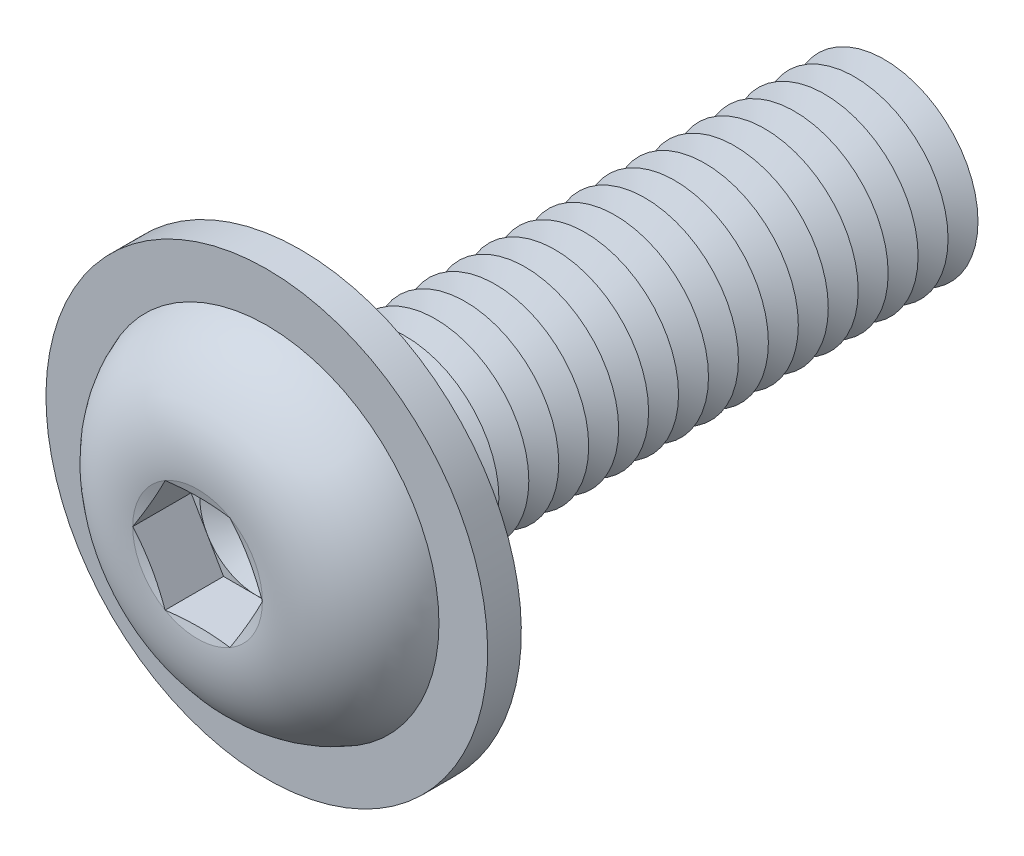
ISO-10303-21;
HEADER;
FILE_DESCRIPTION(('STEP AP214'),'2;1');
FILE_NAME('part.step','',(''),(''),'','','');
FILE_SCHEMA(('AUTOMOTIVE_DESIGN { 1 0 10303 214 1 1 1 1 }'));
ENDSEC;
DATA;
#1=APPLICATION_CONTEXT('core data for automotive mechanical design processes');
#2=APPLICATION_PROTOCOL_DEFINITION('international standard','automotive_design',2000,#1);
#3=PRODUCT_CONTEXT('',#1,'mechanical');
#4=PRODUCT('Part','Part','',(#3));
#5=PRODUCT_RELATED_PRODUCT_CATEGORY('part','',(#4));
#6=PRODUCT_DEFINITION_FORMATION('','',#4);
#7=PRODUCT_DEFINITION_CONTEXT('part definition',#1,'design');
#8=PRODUCT_DEFINITION('design','',#6,#7);
#9=PRODUCT_DEFINITION_SHAPE('','',#8);
#10=(LENGTH_UNIT() NAMED_UNIT(*) SI_UNIT(.MILLI.,.METRE.));
#11=(NAMED_UNIT(*) PLANE_ANGLE_UNIT() SI_UNIT($,.RADIAN.));
#12=(NAMED_UNIT(*) SI_UNIT($,.STERADIAN.) SOLID_ANGLE_UNIT());
#13=UNCERTAINTY_MEASURE_WITH_UNIT(LENGTH_MEASURE(1.E-05),#10,'distance_accuracy_value','');
#14=(GEOMETRIC_REPRESENTATION_CONTEXT(3) GLOBAL_UNCERTAINTY_ASSIGNED_CONTEXT((#13)) GLOBAL_UNIT_ASSIGNED_CONTEXT((#10,
#11,#12)) REPRESENTATION_CONTEXT('',''));
#15=CARTESIAN_POINT('',(0.,0.,0.));
#16=DIRECTION('',(0.,0.,1.));
#17=DIRECTION('',(1.,0.,0.));
#18=AXIS2_PLACEMENT_3D('',#15,#16,#17);
#19=CARTESIAN_POINT('',(0.,0.,-13.2));
#20=DIRECTION('',(0.,0.,1.));
#21=DIRECTION('',(1.,0.,0.));
#22=AXIS2_PLACEMENT_3D('',#19,#20,#21);
#23=CONICAL_SURFACE('',#22,2.50000000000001,1.0471975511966);
#24=CARTESIAN_POINT('',(0.,0.,-13.6));
#25=DIRECTION('',(0.,0.,1.));
#26=DIRECTION('',(1.,0.,0.));
#27=AXIS2_PLACEMENT_3D('',#24,#25,#26);
#28=CIRCLE('',#27,1.80717967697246);
#29=CARTESIAN_POINT('',(1.80717967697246,0.,-13.6));
#30=VERTEX_POINT('',#29);
#31=EDGE_CURVE('E371',#30,#30,#28,.T.);
#32=ORIENTED_EDGE('',*,*,#31,.T.);
#33=EDGE_LOOP('',(#32));
#34=FACE_BOUND('',#33,.T.);
#35=CARTESIAN_POINT('',(0.,0.,-13.2));
#36=DIRECTION('',(0.,0.,1.));
#37=DIRECTION('',(1.,0.,0.));
#38=AXIS2_PLACEMENT_3D('',#35,#36,#37);
#39=CIRCLE('',#38,2.50000000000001);
#40=CARTESIAN_POINT('',(2.50000000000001,0.,-13.2));
#41=VERTEX_POINT('',#40);
#42=EDGE_CURVE('E367',#41,#41,#39,.T.);
#43=ORIENTED_EDGE('',*,*,#42,.F.);
#44=EDGE_LOOP('',(#43));
#45=FACE_BOUND('',#44,.T.);
#46=ADVANCED_FACE('F39',(#34,#45),#23,.T.);
#47=CARTESIAN_POINT('',(0.,0.,-13.6));
#48=DIRECTION('',(0.,0.,-1.));
#49=DIRECTION('',(-1.,0.,0.));
#50=AXIS2_PLACEMENT_3D('',#47,#48,#49);
#51=CONICAL_SURFACE('',#50,1.80717967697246,1.0471975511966);
#52=CARTESIAN_POINT('',(0.,0.,-14.));
#53=DIRECTION('',(0.,0.,1.));
#54=DIRECTION('',(1.,0.,0.));
#55=AXIS2_PLACEMENT_3D('',#52,#53,#54);
#56=CIRCLE('',#55,2.50000000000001);
#57=CARTESIAN_POINT('',(2.50000000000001,0.,-14.));
#58=VERTEX_POINT('',#57);
#59=EDGE_CURVE('E375',#58,#58,#56,.T.);
#60=ORIENTED_EDGE('',*,*,#59,.T.);
#61=EDGE_LOOP('',(#60));
#62=FACE_BOUND('',#61,.T.);
#63=ORIENTED_EDGE('',*,*,#31,.F.);
#64=EDGE_LOOP('',(#63));
#65=FACE_BOUND('',#64,.T.);
#66=ADVANCED_FACE('F503',(#62,#65),#51,.T.);
#67=CARTESIAN_POINT('',(0.,2.50000000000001,-16.));
#68=DIRECTION('',(0.,0.,-1.));
#69=DIRECTION('',(-1.,0.,0.));
#70=AXIS2_PLACEMENT_3D('',#67,#68,#69);
#71=PLANE('',#70);
#72=CARTESIAN_POINT('',(0.,0.,-16.));
#73=DIRECTION('',(0.,0.,1.));
#74=DIRECTION('',(1.,0.,0.));
#75=AXIS2_PLACEMENT_3D('',#72,#73,#74);
#76=CIRCLE('',#75,1.80717967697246);
#77=CARTESIAN_POINT('',(1.80717967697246,0.,-16.));
#78=VERTEX_POINT('',#77);
#79=EDGE_CURVE('E395',#78,#78,#76,.T.);
#80=ORIENTED_EDGE('',*,*,#79,.F.);
#81=EDGE_LOOP('',(#80));
#82=FACE_BOUND('',#81,.T.);
#83=ADVANCED_FACE('F509',(#82),#71,.T.);
#84=CARTESIAN_POINT('',(0.,0.,-15.6));
#85=DIRECTION('',(0.,0.,1.));
#86=DIRECTION('',(1.,0.,0.));
#87=AXIS2_PLACEMENT_3D('',#84,#85,#86);
#88=CONICAL_SURFACE('',#87,2.50000000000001,1.0471975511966);
#89=ORIENTED_EDGE('',*,*,#79,.T.);
#90=EDGE_LOOP('',(#89));
#91=FACE_BOUND('',#90,.T.);
#92=CARTESIAN_POINT('',(0.,0.,-15.6));
#93=DIRECTION('',(0.,0.,1.));
#94=DIRECTION('',(1.,0.,0.));
#95=AXIS2_PLACEMENT_3D('',#92,#93,#94);
#96=CIRCLE('',#95,2.50000000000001);
#97=CARTESIAN_POINT('',(2.50000000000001,0.,-15.6));
#98=VERTEX_POINT('',#97);
#99=EDGE_CURVE('E391',#98,#98,#96,.T.);
#100=ORIENTED_EDGE('',*,*,#99,.F.);
#101=EDGE_LOOP('',(#100));
#102=FACE_BOUND('',#101,.T.);
#103=ADVANCED_FACE('F528',(#91,#102),#88,.T.);
#104=CARTESIAN_POINT('',(0.,0.,-15.2));
#105=DIRECTION('',(0.,0.,-1.));
#106=DIRECTION('',(-1.,0.,0.));
#107=AXIS2_PLACEMENT_3D('',#104,#105,#106);
#108=CONICAL_SURFACE('',#107,1.80717967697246,1.0471975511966);
#109=ORIENTED_EDGE('',*,*,#99,.T.);
#110=EDGE_LOOP('',(#109));
#111=FACE_BOUND('',#110,.T.);
#112=CARTESIAN_POINT('',(0.,0.,-15.2));
#113=DIRECTION('',(0.,0.,1.));
#114=DIRECTION('',(1.,0.,0.));
#115=AXIS2_PLACEMENT_3D('',#112,#113,#114);
#116=CIRCLE('',#115,1.80717967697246);
#117=CARTESIAN_POINT('',(1.80717967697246,0.,-15.2));
#118=VERTEX_POINT('',#117);
#119=EDGE_CURVE('E387',#118,#118,#116,.T.);
#120=ORIENTED_EDGE('',*,*,#119,.F.);
#121=EDGE_LOOP('',(#120));
#122=FACE_BOUND('',#121,.T.);
#123=ADVANCED_FACE('F525',(#111,#122),#108,.T.);
#124=CARTESIAN_POINT('',(0.,0.,-14.8));
#125=DIRECTION('',(0.,0.,1.));
#126=DIRECTION('',(1.,0.,0.));
#127=AXIS2_PLACEMENT_3D('',#124,#125,#126);
#128=CONICAL_SURFACE('',#127,2.50000000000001,1.0471975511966);
#129=ORIENTED_EDGE('',*,*,#119,.T.);
#130=EDGE_LOOP('',(#129));
#131=FACE_BOUND('',#130,.T.);
#132=CARTESIAN_POINT('',(0.,0.,-14.8));
#133=DIRECTION('',(0.,0.,1.));
#134=DIRECTION('',(1.,0.,0.));
#135=AXIS2_PLACEMENT_3D('',#132,#133,#134);
#136=CIRCLE('',#135,2.50000000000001);
#137=CARTESIAN_POINT('',(2.50000000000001,0.,-14.8));
#138=VERTEX_POINT('',#137);
#139=EDGE_CURVE('E383',#138,#138,#136,.T.);
#140=ORIENTED_EDGE('',*,*,#139,.F.);
#141=EDGE_LOOP('',(#140));
#142=FACE_BOUND('',#141,.T.);
#143=ADVANCED_FACE('F519',(#131,#142),#128,.T.);
#144=CARTESIAN_POINT('',(0.,0.,-14.4));
#145=DIRECTION('',(0.,0.,-1.));
#146=DIRECTION('',(-1.,0.,0.));
#147=AXIS2_PLACEMENT_3D('',#144,#145,#146);
#148=CONICAL_SURFACE('',#147,1.80717967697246,1.0471975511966);
#149=ORIENTED_EDGE('',*,*,#139,.T.);
#150=EDGE_LOOP('',(#149));
#151=FACE_BOUND('',#150,.T.);
#152=CARTESIAN_POINT('',(0.,0.,-14.4));
#153=DIRECTION('',(0.,0.,1.));
#154=DIRECTION('',(1.,0.,0.));
#155=AXIS2_PLACEMENT_3D('',#152,#153,#154);
#156=CIRCLE('',#155,1.80717967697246);
#157=CARTESIAN_POINT('',(1.80717967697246,0.,-14.4));
#158=VERTEX_POINT('',#157);
#159=EDGE_CURVE('E379',#158,#158,#156,.T.);
#160=ORIENTED_EDGE('',*,*,#159,.F.);
#161=EDGE_LOOP('',(#160));
#162=FACE_BOUND('',#161,.T.);
#163=ADVANCED_FACE('F515',(#151,#162),#148,.T.);
#164=CARTESIAN_POINT('',(0.,0.,-14.));
#165=DIRECTION('',(0.,0.,1.));
#166=DIRECTION('',(1.,0.,0.));
#167=AXIS2_PLACEMENT_3D('',#164,#165,#166);
#168=CONICAL_SURFACE('',#167,2.50000000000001,1.0471975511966);
#169=ORIENTED_EDGE('',*,*,#159,.T.);
#170=EDGE_LOOP('',(#169));
#171=FACE_BOUND('',#170,.T.);
#172=ORIENTED_EDGE('',*,*,#59,.F.);
#173=EDGE_LOOP('',(#172));
#174=FACE_BOUND('',#173,.T.);
#175=ADVANCED_FACE('F518',(#171,#174),#168,.T.);
#176=CARTESIAN_POINT('',(0.,0.,-12.4));
#177=DIRECTION('',(0.,0.,1.));
#178=DIRECTION('',(1.,0.,0.));
#179=AXIS2_PLACEMENT_3D('',#176,#177,#178);
#180=CONICAL_SURFACE('',#179,2.50000000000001,1.0471975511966);
#181=CARTESIAN_POINT('',(0.,0.,-12.8));
#182=DIRECTION('',(0.,0.,1.));
#183=DIRECTION('',(1.,0.,0.));
#184=AXIS2_PLACEMENT_3D('',#181,#182,#183);
#185=CIRCLE('',#184,1.80717967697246);
#186=CARTESIAN_POINT('',(1.80717967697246,0.,-12.8));
#187=VERTEX_POINT('',#186);
#188=EDGE_CURVE('E363',#187,#187,#185,.T.);
#189=ORIENTED_EDGE('',*,*,#188,.T.);
#190=EDGE_LOOP('',(#189));
#191=FACE_BOUND('',#190,.T.);
#192=CARTESIAN_POINT('',(0.,0.,-12.4));
#193=DIRECTION('',(0.,0.,1.));
#194=DIRECTION('',(1.,0.,0.));
#195=AXIS2_PLACEMENT_3D('',#192,#193,#194);
#196=CIRCLE('',#195,2.50000000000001);
#197=CARTESIAN_POINT('',(2.50000000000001,0.,-12.4));
#198=VERTEX_POINT('',#197);
#199=EDGE_CURVE('E359',#198,#198,#196,.T.);
#200=ORIENTED_EDGE('',*,*,#199,.F.);
#201=EDGE_LOOP('',(#200));
#202=FACE_BOUND('',#201,.T.);
#203=ADVANCED_FACE('F523',(#191,#202),#180,.T.);
#204=CARTESIAN_POINT('',(0.,0.,-12.8));
#205=DIRECTION('',(0.,0.,-1.));
#206=DIRECTION('',(-1.,0.,0.));
#207=AXIS2_PLACEMENT_3D('',#204,#205,#206);
#208=CONICAL_SURFACE('',#207,1.80717967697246,1.0471975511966);
#209=ORIENTED_EDGE('',*,*,#42,.T.);
#210=EDGE_LOOP('',(#209));
#211=FACE_BOUND('',#210,.T.);
#212=ORIENTED_EDGE('',*,*,#188,.F.);
#213=EDGE_LOOP('',(#212));
#214=FACE_BOUND('',#213,.T.);
#215=ADVANCED_FACE('F574',(#211,#214),#208,.T.);
#216=CARTESIAN_POINT('',(0.,0.,-11.6));
#217=DIRECTION('',(0.,0.,1.));
#218=DIRECTION('',(1.,0.,0.));
#219=AXIS2_PLACEMENT_3D('',#216,#217,#218);
#220=CONICAL_SURFACE('',#219,2.50000000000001,1.0471975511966);
#221=CARTESIAN_POINT('',(0.,0.,-12.));
#222=DIRECTION('',(0.,0.,1.));
#223=DIRECTION('',(1.,0.,0.));
#224=AXIS2_PLACEMENT_3D('',#221,#222,#223);
#225=CIRCLE('',#224,1.80717967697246);
#226=CARTESIAN_POINT('',(1.80717967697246,0.,-12.));
#227=VERTEX_POINT('',#226);
#228=EDGE_CURVE('E355',#227,#227,#225,.T.);
#229=ORIENTED_EDGE('',*,*,#228,.T.);
#230=EDGE_LOOP('',(#229));
#231=FACE_BOUND('',#230,.T.);
#232=CARTESIAN_POINT('',(0.,0.,-11.6));
#233=DIRECTION('',(0.,0.,1.));
#234=DIRECTION('',(1.,0.,0.));
#235=AXIS2_PLACEMENT_3D('',#232,#233,#234);
#236=CIRCLE('',#235,2.50000000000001);
#237=CARTESIAN_POINT('',(2.50000000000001,0.,-11.6));
#238=VERTEX_POINT('',#237);
#239=EDGE_CURVE('E351',#238,#238,#236,.T.);
#240=ORIENTED_EDGE('',*,*,#239,.F.);
#241=EDGE_LOOP('',(#240));
#242=FACE_BOUND('',#241,.T.);
#243=ADVANCED_FACE('F580',(#231,#242),#220,.T.);
#244=CARTESIAN_POINT('',(0.,0.,-12.));
#245=DIRECTION('',(0.,0.,-1.));
#246=DIRECTION('',(-1.,0.,0.));
#247=AXIS2_PLACEMENT_3D('',#244,#245,#246);
#248=CONICAL_SURFACE('',#247,1.80717967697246,1.0471975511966);
#249=ORIENTED_EDGE('',*,*,#199,.T.);
#250=EDGE_LOOP('',(#249));
#251=FACE_BOUND('',#250,.T.);
#252=ORIENTED_EDGE('',*,*,#228,.F.);
#253=EDGE_LOOP('',(#252));
#254=FACE_BOUND('',#253,.T.);
#255=ADVANCED_FACE('F587',(#251,#254),#248,.T.);
#256=CARTESIAN_POINT('',(0.,0.,-10.8));
#257=DIRECTION('',(0.,0.,1.));
#258=DIRECTION('',(1.,0.,0.));
#259=AXIS2_PLACEMENT_3D('',#256,#257,#258);
#260=CONICAL_SURFACE('',#259,2.50000000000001,1.0471975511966);
#261=CARTESIAN_POINT('',(0.,0.,-11.2));
#262=DIRECTION('',(0.,0.,1.));
#263=DIRECTION('',(1.,0.,0.));
#264=AXIS2_PLACEMENT_3D('',#261,#262,#263);
#265=CIRCLE('',#264,1.80717967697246);
#266=CARTESIAN_POINT('',(1.80717967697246,0.,-11.2));
#267=VERTEX_POINT('',#266);
#268=EDGE_CURVE('E347',#267,#267,#265,.T.);
#269=ORIENTED_EDGE('',*,*,#268,.T.);
#270=EDGE_LOOP('',(#269));
#271=FACE_BOUND('',#270,.T.);
#272=CARTESIAN_POINT('',(0.,0.,-10.8));
#273=DIRECTION('',(0.,0.,1.));
#274=DIRECTION('',(1.,0.,0.));
#275=AXIS2_PLACEMENT_3D('',#272,#273,#274);
#276=CIRCLE('',#275,2.50000000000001);
#277=CARTESIAN_POINT('',(2.50000000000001,0.,-10.8));
#278=VERTEX_POINT('',#277);
#279=EDGE_CURVE('E343',#278,#278,#276,.T.);
#280=ORIENTED_EDGE('',*,*,#279,.F.);
#281=EDGE_LOOP('',(#280));
#282=FACE_BOUND('',#281,.T.);
#283=ADVANCED_FACE('F594',(#271,#282),#260,.T.);
#284=CARTESIAN_POINT('',(0.,0.,-11.2));
#285=DIRECTION('',(0.,0.,-1.));
#286=DIRECTION('',(-1.,0.,0.));
#287=AXIS2_PLACEMENT_3D('',#284,#285,#286);
#288=CONICAL_SURFACE('',#287,1.80717967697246,1.0471975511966);
#289=ORIENTED_EDGE('',*,*,#239,.T.);
#290=EDGE_LOOP('',(#289));
#291=FACE_BOUND('',#290,.T.);
#292=ORIENTED_EDGE('',*,*,#268,.F.);
#293=EDGE_LOOP('',(#292));
#294=FACE_BOUND('',#293,.T.);
#295=ADVANCED_FACE('F601',(#291,#294),#288,.T.);
#296=CARTESIAN_POINT('',(0.,0.,-10.));
#297=DIRECTION('',(0.,0.,1.));
#298=DIRECTION('',(1.,0.,0.));
#299=AXIS2_PLACEMENT_3D('',#296,#297,#298);
#300=CONICAL_SURFACE('',#299,2.50000000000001,1.0471975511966);
#301=CARTESIAN_POINT('',(0.,0.,-10.4));
#302=DIRECTION('',(0.,0.,1.));
#303=DIRECTION('',(1.,0.,0.));
#304=AXIS2_PLACEMENT_3D('',#301,#302,#303);
#305=CIRCLE('',#304,1.80717967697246);
#306=CARTESIAN_POINT('',(1.80717967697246,0.,-10.4));
#307=VERTEX_POINT('',#306);
#308=EDGE_CURVE('E339',#307,#307,#305,.T.);
#309=ORIENTED_EDGE('',*,*,#308,.T.);
#310=EDGE_LOOP('',(#309));
#311=FACE_BOUND('',#310,.T.);
#312=CARTESIAN_POINT('',(0.,0.,-10.));
#313=DIRECTION('',(0.,0.,1.));
#314=DIRECTION('',(1.,0.,0.));
#315=AXIS2_PLACEMENT_3D('',#312,#313,#314);
#316=CIRCLE('',#315,2.50000000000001);
#317=CARTESIAN_POINT('',(2.50000000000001,0.,-10.));
#318=VERTEX_POINT('',#317);
#319=EDGE_CURVE('E335',#318,#318,#316,.T.);
#320=ORIENTED_EDGE('',*,*,#319,.F.);
#321=EDGE_LOOP('',(#320));
#322=FACE_BOUND('',#321,.T.);
#323=ADVANCED_FACE('F608',(#311,#322),#300,.T.);
#324=CARTESIAN_POINT('',(0.,0.,-10.4));
#325=DIRECTION('',(0.,0.,-1.));
#326=DIRECTION('',(-1.,0.,0.));
#327=AXIS2_PLACEMENT_3D('',#324,#325,#326);
#328=CONICAL_SURFACE('',#327,1.80717967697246,1.0471975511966);
#329=ORIENTED_EDGE('',*,*,#279,.T.);
#330=EDGE_LOOP('',(#329));
#331=FACE_BOUND('',#330,.T.);
#332=ORIENTED_EDGE('',*,*,#308,.F.);
#333=EDGE_LOOP('',(#332));
#334=FACE_BOUND('',#333,.T.);
#335=ADVANCED_FACE('F615',(#331,#334),#328,.T.);
#336=CARTESIAN_POINT('',(0.,0.,-9.2));
#337=DIRECTION('',(0.,0.,1.));
#338=DIRECTION('',(1.,0.,0.));
#339=AXIS2_PLACEMENT_3D('',#336,#337,#338);
#340=CONICAL_SURFACE('',#339,2.50000000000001,1.0471975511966);
#341=CARTESIAN_POINT('',(0.,0.,-9.6));
#342=DIRECTION('',(0.,0.,1.));
#343=DIRECTION('',(1.,0.,0.));
#344=AXIS2_PLACEMENT_3D('',#341,#342,#343);
#345=CIRCLE('',#344,1.80717967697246);
#346=CARTESIAN_POINT('',(1.80717967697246,0.,-9.6));
#347=VERTEX_POINT('',#346);
#348=EDGE_CURVE('E331',#347,#347,#345,.T.);
#349=ORIENTED_EDGE('',*,*,#348,.T.);
#350=EDGE_LOOP('',(#349));
#351=FACE_BOUND('',#350,.T.);
#352=CARTESIAN_POINT('',(0.,0.,-9.2));
#353=DIRECTION('',(0.,0.,1.));
#354=DIRECTION('',(1.,0.,0.));
#355=AXIS2_PLACEMENT_3D('',#352,#353,#354);
#356=CIRCLE('',#355,2.50000000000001);
#357=CARTESIAN_POINT('',(2.50000000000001,0.,-9.2));
#358=VERTEX_POINT('',#357);
#359=EDGE_CURVE('E327',#358,#358,#356,.T.);
#360=ORIENTED_EDGE('',*,*,#359,.F.);
#361=EDGE_LOOP('',(#360));
#362=FACE_BOUND('',#361,.T.);
#363=ADVANCED_FACE('F622',(#351,#362),#340,.T.);
#364=CARTESIAN_POINT('',(0.,0.,-9.6));
#365=DIRECTION('',(0.,0.,-1.));
#366=DIRECTION('',(-1.,0.,0.));
#367=AXIS2_PLACEMENT_3D('',#364,#365,#366);
#368=CONICAL_SURFACE('',#367,1.80717967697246,1.0471975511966);
#369=ORIENTED_EDGE('',*,*,#319,.T.);
#370=EDGE_LOOP('',(#369));
#371=FACE_BOUND('',#370,.T.);
#372=ORIENTED_EDGE('',*,*,#348,.F.);
#373=EDGE_LOOP('',(#372));
#374=FACE_BOUND('',#373,.T.);
#375=ADVANCED_FACE('F629',(#371,#374),#368,.T.);
#376=CARTESIAN_POINT('',(0.,0.,-8.4));
#377=DIRECTION('',(0.,0.,1.));
#378=DIRECTION('',(1.,0.,0.));
#379=AXIS2_PLACEMENT_3D('',#376,#377,#378);
#380=CONICAL_SURFACE('',#379,2.50000000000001,1.0471975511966);
#381=CARTESIAN_POINT('',(0.,0.,-8.8));
#382=DIRECTION('',(0.,0.,1.));
#383=DIRECTION('',(1.,0.,0.));
#384=AXIS2_PLACEMENT_3D('',#381,#382,#383);
#385=CIRCLE('',#384,1.80717967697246);
#386=CARTESIAN_POINT('',(1.80717967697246,0.,-8.8));
#387=VERTEX_POINT('',#386);
#388=EDGE_CURVE('E323',#387,#387,#385,.T.);
#389=ORIENTED_EDGE('',*,*,#388,.T.);
#390=EDGE_LOOP('',(#389));
#391=FACE_BOUND('',#390,.T.);
#392=CARTESIAN_POINT('',(0.,0.,-8.4));
#393=DIRECTION('',(0.,0.,1.));
#394=DIRECTION('',(1.,0.,0.));
#395=AXIS2_PLACEMENT_3D('',#392,#393,#394);
#396=CIRCLE('',#395,2.50000000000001);
#397=CARTESIAN_POINT('',(2.50000000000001,0.,-8.4));
#398=VERTEX_POINT('',#397);
#399=EDGE_CURVE('E319',#398,#398,#396,.T.);
#400=ORIENTED_EDGE('',*,*,#399,.F.);
#401=EDGE_LOOP('',(#400));
#402=FACE_BOUND('',#401,.T.);
#403=ADVANCED_FACE('F636',(#391,#402),#380,.T.);
#404=CARTESIAN_POINT('',(0.,0.,-8.8));
#405=DIRECTION('',(0.,0.,-1.));
#406=DIRECTION('',(-1.,0.,0.));
#407=AXIS2_PLACEMENT_3D('',#404,#405,#406);
#408=CONICAL_SURFACE('',#407,1.80717967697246,1.0471975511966);
#409=ORIENTED_EDGE('',*,*,#359,.T.);
#410=EDGE_LOOP('',(#409));
#411=FACE_BOUND('',#410,.T.);
#412=ORIENTED_EDGE('',*,*,#388,.F.);
#413=EDGE_LOOP('',(#412));
#414=FACE_BOUND('',#413,.T.);
#415=ADVANCED_FACE('F643',(#411,#414),#408,.T.);
#416=CARTESIAN_POINT('',(0.,0.,-7.6));
#417=DIRECTION('',(0.,0.,1.));
#418=DIRECTION('',(1.,0.,0.));
#419=AXIS2_PLACEMENT_3D('',#416,#417,#418);
#420=CONICAL_SURFACE('',#419,2.50000000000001,1.0471975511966);
#421=CARTESIAN_POINT('',(0.,0.,-8.));
#422=DIRECTION('',(0.,0.,1.));
#423=DIRECTION('',(1.,0.,0.));
#424=AXIS2_PLACEMENT_3D('',#421,#422,#423);
#425=CIRCLE('',#424,1.80717967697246);
#426=CARTESIAN_POINT('',(1.80717967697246,0.,-8.));
#427=VERTEX_POINT('',#426);
#428=EDGE_CURVE('E315',#427,#427,#425,.T.);
#429=ORIENTED_EDGE('',*,*,#428,.T.);
#430=EDGE_LOOP('',(#429));
#431=FACE_BOUND('',#430,.T.);
#432=CARTESIAN_POINT('',(0.,0.,-7.6));
#433=DIRECTION('',(0.,0.,1.));
#434=DIRECTION('',(1.,0.,0.));
#435=AXIS2_PLACEMENT_3D('',#432,#433,#434);
#436=CIRCLE('',#435,2.50000000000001);
#437=CARTESIAN_POINT('',(2.50000000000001,0.,-7.6));
#438=VERTEX_POINT('',#437);
#439=EDGE_CURVE('E311',#438,#438,#436,.T.);
#440=ORIENTED_EDGE('',*,*,#439,.F.);
#441=EDGE_LOOP('',(#440));
#442=FACE_BOUND('',#441,.T.);
#443=ADVANCED_FACE('F650',(#431,#442),#420,.T.);
#444=CARTESIAN_POINT('',(0.,0.,-8.));
#445=DIRECTION('',(0.,0.,-1.));
#446=DIRECTION('',(-1.,0.,0.));
#447=AXIS2_PLACEMENT_3D('',#444,#445,#446);
#448=CONICAL_SURFACE('',#447,1.80717967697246,1.0471975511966);
#449=ORIENTED_EDGE('',*,*,#399,.T.);
#450=EDGE_LOOP('',(#449));
#451=FACE_BOUND('',#450,.T.);
#452=ORIENTED_EDGE('',*,*,#428,.F.);
#453=EDGE_LOOP('',(#452));
#454=FACE_BOUND('',#453,.T.);
#455=ADVANCED_FACE('F657',(#451,#454),#448,.T.);
#456=CARTESIAN_POINT('',(0.,0.,-6.8));
#457=DIRECTION('',(0.,0.,1.));
#458=DIRECTION('',(1.,0.,0.));
#459=AXIS2_PLACEMENT_3D('',#456,#457,#458);
#460=CONICAL_SURFACE('',#459,2.50000000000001,1.0471975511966);
#461=CARTESIAN_POINT('',(0.,0.,-7.2));
#462=DIRECTION('',(0.,0.,1.));
#463=DIRECTION('',(1.,0.,0.));
#464=AXIS2_PLACEMENT_3D('',#461,#462,#463);
#465=CIRCLE('',#464,1.80717967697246);
#466=CARTESIAN_POINT('',(1.80717967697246,0.,-7.2));
#467=VERTEX_POINT('',#466);
#468=EDGE_CURVE('E307',#467,#467,#465,.T.);
#469=ORIENTED_EDGE('',*,*,#468,.T.);
#470=EDGE_LOOP('',(#469));
#471=FACE_BOUND('',#470,.T.);
#472=CARTESIAN_POINT('',(0.,0.,-6.8));
#473=DIRECTION('',(0.,0.,1.));
#474=DIRECTION('',(1.,0.,0.));
#475=AXIS2_PLACEMENT_3D('',#472,#473,#474);
#476=CIRCLE('',#475,2.50000000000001);
#477=CARTESIAN_POINT('',(2.50000000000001,0.,-6.8));
#478=VERTEX_POINT('',#477);
#479=EDGE_CURVE('E303',#478,#478,#476,.T.);
#480=ORIENTED_EDGE('',*,*,#479,.F.);
#481=EDGE_LOOP('',(#480));
#482=FACE_BOUND('',#481,.T.);
#483=ADVANCED_FACE('F664',(#471,#482),#460,.T.);
#484=CARTESIAN_POINT('',(0.,0.,-7.2));
#485=DIRECTION('',(0.,0.,-1.));
#486=DIRECTION('',(-1.,0.,0.));
#487=AXIS2_PLACEMENT_3D('',#484,#485,#486);
#488=CONICAL_SURFACE('',#487,1.80717967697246,1.0471975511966);
#489=ORIENTED_EDGE('',*,*,#439,.T.);
#490=EDGE_LOOP('',(#489));
#491=FACE_BOUND('',#490,.T.);
#492=ORIENTED_EDGE('',*,*,#468,.F.);
#493=EDGE_LOOP('',(#492));
#494=FACE_BOUND('',#493,.T.);
#495=ADVANCED_FACE('F671',(#491,#494),#488,.T.);
#496=CARTESIAN_POINT('',(0.,0.,-6.));
#497=DIRECTION('',(0.,0.,1.));
#498=DIRECTION('',(1.,0.,0.));
#499=AXIS2_PLACEMENT_3D('',#496,#497,#498);
#500=CONICAL_SURFACE('',#499,2.50000000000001,1.0471975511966);
#501=CARTESIAN_POINT('',(0.,0.,-6.4));
#502=DIRECTION('',(0.,0.,1.));
#503=DIRECTION('',(1.,0.,0.));
#504=AXIS2_PLACEMENT_3D('',#501,#502,#503);
#505=CIRCLE('',#504,1.80717967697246);
#506=CARTESIAN_POINT('',(1.80717967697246,0.,-6.4));
#507=VERTEX_POINT('',#506);
#508=EDGE_CURVE('E299',#507,#507,#505,.T.);
#509=ORIENTED_EDGE('',*,*,#508,.T.);
#510=EDGE_LOOP('',(#509));
#511=FACE_BOUND('',#510,.T.);
#512=CARTESIAN_POINT('',(0.,0.,-6.));
#513=DIRECTION('',(0.,0.,1.));
#514=DIRECTION('',(1.,0.,0.));
#515=AXIS2_PLACEMENT_3D('',#512,#513,#514);
#516=CIRCLE('',#515,2.50000000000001);
#517=CARTESIAN_POINT('',(2.50000000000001,0.,-6.));
#518=VERTEX_POINT('',#517);
#519=EDGE_CURVE('E295',#518,#518,#516,.T.);
#520=ORIENTED_EDGE('',*,*,#519,.F.);
#521=EDGE_LOOP('',(#520));
#522=FACE_BOUND('',#521,.T.);
#523=ADVANCED_FACE('F678',(#511,#522),#500,.T.);
#524=CARTESIAN_POINT('',(0.,0.,-6.4));
#525=DIRECTION('',(0.,0.,-1.));
#526=DIRECTION('',(-1.,0.,0.));
#527=AXIS2_PLACEMENT_3D('',#524,#525,#526);
#528=CONICAL_SURFACE('',#527,1.80717967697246,1.0471975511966);
#529=ORIENTED_EDGE('',*,*,#479,.T.);
#530=EDGE_LOOP('',(#529));
#531=FACE_BOUND('',#530,.T.);
#532=ORIENTED_EDGE('',*,*,#508,.F.);
#533=EDGE_LOOP('',(#532));
#534=FACE_BOUND('',#533,.T.);
#535=ADVANCED_FACE('F685',(#531,#534),#528,.T.);
#536=CARTESIAN_POINT('',(0.,0.,-5.2));
#537=DIRECTION('',(0.,0.,1.));
#538=DIRECTION('',(1.,0.,0.));
#539=AXIS2_PLACEMENT_3D('',#536,#537,#538);
#540=CONICAL_SURFACE('',#539,2.50000000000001,1.0471975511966);
#541=CARTESIAN_POINT('',(0.,0.,-5.6));
#542=DIRECTION('',(0.,0.,1.));
#543=DIRECTION('',(1.,0.,0.));
#544=AXIS2_PLACEMENT_3D('',#541,#542,#543);
#545=CIRCLE('',#544,1.80717967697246);
#546=CARTESIAN_POINT('',(1.80717967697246,0.,-5.6));
#547=VERTEX_POINT('',#546);
#548=EDGE_CURVE('E291',#547,#547,#545,.T.);
#549=ORIENTED_EDGE('',*,*,#548,.T.);
#550=EDGE_LOOP('',(#549));
#551=FACE_BOUND('',#550,.T.);
#552=CARTESIAN_POINT('',(0.,0.,-5.2));
#553=DIRECTION('',(0.,0.,1.));
#554=DIRECTION('',(1.,0.,0.));
#555=AXIS2_PLACEMENT_3D('',#552,#553,#554);
#556=CIRCLE('',#555,2.50000000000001);
#557=CARTESIAN_POINT('',(2.50000000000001,0.,-5.2));
#558=VERTEX_POINT('',#557);
#559=EDGE_CURVE('E287',#558,#558,#556,.T.);
#560=ORIENTED_EDGE('',*,*,#559,.F.);
#561=EDGE_LOOP('',(#560));
#562=FACE_BOUND('',#561,.T.);
#563=ADVANCED_FACE('F692',(#551,#562),#540,.T.);
#564=CARTESIAN_POINT('',(0.,0.,-5.6));
#565=DIRECTION('',(0.,0.,-1.));
#566=DIRECTION('',(-1.,0.,0.));
#567=AXIS2_PLACEMENT_3D('',#564,#565,#566);
#568=CONICAL_SURFACE('',#567,1.80717967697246,1.0471975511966);
#569=ORIENTED_EDGE('',*,*,#519,.T.);
#570=EDGE_LOOP('',(#569));
#571=FACE_BOUND('',#570,.T.);
#572=ORIENTED_EDGE('',*,*,#548,.F.);
#573=EDGE_LOOP('',(#572));
#574=FACE_BOUND('',#573,.T.);
#575=ADVANCED_FACE('F699',(#571,#574),#568,.T.);
#576=CARTESIAN_POINT('',(0.,0.,-4.4));
#577=DIRECTION('',(0.,0.,1.));
#578=DIRECTION('',(1.,0.,0.));
#579=AXIS2_PLACEMENT_3D('',#576,#577,#578);
#580=CONICAL_SURFACE('',#579,2.50000000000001,1.0471975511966);
#581=CARTESIAN_POINT('',(0.,0.,-4.8));
#582=DIRECTION('',(0.,0.,1.));
#583=DIRECTION('',(1.,0.,0.));
#584=AXIS2_PLACEMENT_3D('',#581,#582,#583);
#585=CIRCLE('',#584,1.80717967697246);
#586=CARTESIAN_POINT('',(1.80717967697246,0.,-4.8));
#587=VERTEX_POINT('',#586);
#588=EDGE_CURVE('E283',#587,#587,#585,.T.);
#589=ORIENTED_EDGE('',*,*,#588,.T.);
#590=EDGE_LOOP('',(#589));
#591=FACE_BOUND('',#590,.T.);
#592=CARTESIAN_POINT('',(0.,0.,-4.4));
#593=DIRECTION('',(0.,0.,1.));
#594=DIRECTION('',(1.,0.,0.));
#595=AXIS2_PLACEMENT_3D('',#592,#593,#594);
#596=CIRCLE('',#595,2.50000000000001);
#597=CARTESIAN_POINT('',(2.50000000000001,0.,-4.4));
#598=VERTEX_POINT('',#597);
#599=EDGE_CURVE('E279',#598,#598,#596,.T.);
#600=ORIENTED_EDGE('',*,*,#599,.F.);
#601=EDGE_LOOP('',(#600));
#602=FACE_BOUND('',#601,.T.);
#603=ADVANCED_FACE('F706',(#591,#602),#580,.T.);
#604=CARTESIAN_POINT('',(0.,0.,-4.8));
#605=DIRECTION('',(0.,0.,-1.));
#606=DIRECTION('',(-1.,0.,0.));
#607=AXIS2_PLACEMENT_3D('',#604,#605,#606);
#608=CONICAL_SURFACE('',#607,1.80717967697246,1.0471975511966);
#609=ORIENTED_EDGE('',*,*,#559,.T.);
#610=EDGE_LOOP('',(#609));
#611=FACE_BOUND('',#610,.T.);
#612=ORIENTED_EDGE('',*,*,#588,.F.);
#613=EDGE_LOOP('',(#612));
#614=FACE_BOUND('',#613,.T.);
#615=ADVANCED_FACE('F713',(#611,#614),#608,.T.);
#616=CARTESIAN_POINT('',(0.,0.,-3.6));
#617=DIRECTION('',(0.,0.,1.));
#618=DIRECTION('',(1.,0.,0.));
#619=AXIS2_PLACEMENT_3D('',#616,#617,#618);
#620=CONICAL_SURFACE('',#619,2.50000000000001,1.0471975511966);
#621=CARTESIAN_POINT('',(0.,0.,-4.));
#622=DIRECTION('',(0.,0.,1.));
#623=DIRECTION('',(1.,0.,0.));
#624=AXIS2_PLACEMENT_3D('',#621,#622,#623);
#625=CIRCLE('',#624,1.80717967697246);
#626=CARTESIAN_POINT('',(1.80717967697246,0.,-4.));
#627=VERTEX_POINT('',#626);
#628=EDGE_CURVE('E275',#627,#627,#625,.T.);
#629=ORIENTED_EDGE('',*,*,#628,.T.);
#630=EDGE_LOOP('',(#629));
#631=FACE_BOUND('',#630,.T.);
#632=CARTESIAN_POINT('',(0.,0.,-3.6));
#633=DIRECTION('',(0.,0.,1.));
#634=DIRECTION('',(1.,0.,0.));
#635=AXIS2_PLACEMENT_3D('',#632,#633,#634);
#636=CIRCLE('',#635,2.50000000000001);
#637=CARTESIAN_POINT('',(2.50000000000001,0.,-3.6));
#638=VERTEX_POINT('',#637);
#639=EDGE_CURVE('E271',#638,#638,#636,.T.);
#640=ORIENTED_EDGE('',*,*,#639,.F.);
#641=EDGE_LOOP('',(#640));
#642=FACE_BOUND('',#641,.T.);
#643=ADVANCED_FACE('F720',(#631,#642),#620,.T.);
#644=CARTESIAN_POINT('',(0.,0.,-4.));
#645=DIRECTION('',(0.,0.,-1.));
#646=DIRECTION('',(-1.,0.,0.));
#647=AXIS2_PLACEMENT_3D('',#644,#645,#646);
#648=CONICAL_SURFACE('',#647,1.80717967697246,1.0471975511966);
#649=ORIENTED_EDGE('',*,*,#599,.T.);
#650=EDGE_LOOP('',(#649));
#651=FACE_BOUND('',#650,.T.);
#652=ORIENTED_EDGE('',*,*,#628,.F.);
#653=EDGE_LOOP('',(#652));
#654=FACE_BOUND('',#653,.T.);
#655=ADVANCED_FACE('F727',(#651,#654),#648,.T.);
#656=CARTESIAN_POINT('',(0.,0.,-2.8));
#657=DIRECTION('',(0.,0.,1.));
#658=DIRECTION('',(1.,0.,0.));
#659=AXIS2_PLACEMENT_3D('',#656,#657,#658);
#660=CONICAL_SURFACE('',#659,2.50000000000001,1.0471975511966);
#661=CARTESIAN_POINT('',(0.,0.,-3.2));
#662=DIRECTION('',(0.,0.,1.));
#663=DIRECTION('',(1.,0.,0.));
#664=AXIS2_PLACEMENT_3D('',#661,#662,#663);
#665=CIRCLE('',#664,1.80717967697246);
#666=CARTESIAN_POINT('',(1.80717967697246,0.,-3.2));
#667=VERTEX_POINT('',#666);
#668=EDGE_CURVE('E267',#667,#667,#665,.T.);
#669=ORIENTED_EDGE('',*,*,#668,.T.);
#670=EDGE_LOOP('',(#669));
#671=FACE_BOUND('',#670,.T.);
#672=CARTESIAN_POINT('',(0.,0.,-2.8));
#673=DIRECTION('',(0.,0.,1.));
#674=DIRECTION('',(1.,0.,0.));
#675=AXIS2_PLACEMENT_3D('',#672,#673,#674);
#676=CIRCLE('',#675,2.50000000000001);
#677=CARTESIAN_POINT('',(2.50000000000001,0.,-2.8));
#678=VERTEX_POINT('',#677);
#679=EDGE_CURVE('E263',#678,#678,#676,.T.);
#680=ORIENTED_EDGE('',*,*,#679,.F.);
#681=EDGE_LOOP('',(#680));
#682=FACE_BOUND('',#681,.T.);
#683=ADVANCED_FACE('F734',(#671,#682),#660,.T.);
#684=CARTESIAN_POINT('',(0.,0.,-3.2));
#685=DIRECTION('',(0.,0.,-1.));
#686=DIRECTION('',(-1.,0.,0.));
#687=AXIS2_PLACEMENT_3D('',#684,#685,#686);
#688=CONICAL_SURFACE('',#687,1.80717967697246,1.0471975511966);
#689=ORIENTED_EDGE('',*,*,#639,.T.);
#690=EDGE_LOOP('',(#689));
#691=FACE_BOUND('',#690,.T.);
#692=ORIENTED_EDGE('',*,*,#668,.F.);
#693=EDGE_LOOP('',(#692));
#694=FACE_BOUND('',#693,.T.);
#695=ADVANCED_FACE('F741',(#691,#694),#688,.T.);
#696=CARTESIAN_POINT('',(0.,0.,-2.));
#697=DIRECTION('',(0.,0.,1.));
#698=DIRECTION('',(1.,0.,0.));
#699=AXIS2_PLACEMENT_3D('',#696,#697,#698);
#700=CONICAL_SURFACE('',#699,2.50000000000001,1.0471975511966);
#701=CARTESIAN_POINT('',(0.,0.,-2.4));
#702=DIRECTION('',(0.,0.,1.));
#703=DIRECTION('',(1.,0.,0.));
#704=AXIS2_PLACEMENT_3D('',#701,#702,#703);
#705=CIRCLE('',#704,1.80717967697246);
#706=CARTESIAN_POINT('',(1.80717967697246,0.,-2.4));
#707=VERTEX_POINT('',#706);
#708=EDGE_CURVE('E259',#707,#707,#705,.T.);
#709=ORIENTED_EDGE('',*,*,#708,.T.);
#710=EDGE_LOOP('',(#709));
#711=FACE_BOUND('',#710,.T.);
#712=CARTESIAN_POINT('',(0.,0.,-2.));
#713=DIRECTION('',(0.,0.,1.));
#714=DIRECTION('',(1.,0.,0.));
#715=AXIS2_PLACEMENT_3D('',#712,#713,#714);
#716=CIRCLE('',#715,2.50000000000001);
#717=CARTESIAN_POINT('',(2.50000000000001,0.,-2.));
#718=VERTEX_POINT('',#717);
#719=EDGE_CURVE('E255',#718,#718,#716,.T.);
#720=ORIENTED_EDGE('',*,*,#719,.F.);
#721=EDGE_LOOP('',(#720));
#722=FACE_BOUND('',#721,.T.);
#723=ADVANCED_FACE('F748',(#711,#722),#700,.T.);
#724=CARTESIAN_POINT('',(0.,0.,-2.4));
#725=DIRECTION('',(0.,0.,-1.));
#726=DIRECTION('',(-1.,0.,0.));
#727=AXIS2_PLACEMENT_3D('',#724,#725,#726);
#728=CONICAL_SURFACE('',#727,1.80717967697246,1.0471975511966);
#729=ORIENTED_EDGE('',*,*,#679,.T.);
#730=EDGE_LOOP('',(#729));
#731=FACE_BOUND('',#730,.T.);
#732=ORIENTED_EDGE('',*,*,#708,.F.);
#733=EDGE_LOOP('',(#732));
#734=FACE_BOUND('',#733,.T.);
#735=ADVANCED_FACE('F755',(#731,#734),#728,.T.);
#736=CARTESIAN_POINT('',(0.,0.,-1.2));
#737=DIRECTION('',(0.,0.,1.));
#738=DIRECTION('',(1.,0.,0.));
#739=AXIS2_PLACEMENT_3D('',#736,#737,#738);
#740=CONICAL_SURFACE('',#739,2.50000000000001,1.0471975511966);
#741=CARTESIAN_POINT('',(0.,0.,-1.6));
#742=DIRECTION('',(0.,0.,1.));
#743=DIRECTION('',(1.,0.,0.));
#744=AXIS2_PLACEMENT_3D('',#741,#742,#743);
#745=CIRCLE('',#744,1.80717967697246);
#746=CARTESIAN_POINT('',(1.80717967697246,0.,-1.6));
#747=VERTEX_POINT('',#746);
#748=EDGE_CURVE('E251',#747,#747,#745,.T.);
#749=ORIENTED_EDGE('',*,*,#748,.T.);
#750=EDGE_LOOP('',(#749));
#751=FACE_BOUND('',#750,.T.);
#752=CARTESIAN_POINT('',(0.,0.,-1.2));
#753=DIRECTION('',(0.,0.,1.));
#754=DIRECTION('',(1.,0.,0.));
#755=AXIS2_PLACEMENT_3D('',#752,#753,#754);
#756=CIRCLE('',#755,2.50000000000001);
#757=CARTESIAN_POINT('',(2.50000000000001,0.,-1.2));
#758=VERTEX_POINT('',#757);
#759=EDGE_CURVE('E243',#758,#758,#756,.T.);
#760=ORIENTED_EDGE('',*,*,#759,.F.);
#761=EDGE_LOOP('',(#760));
#762=FACE_BOUND('',#761,.T.);
#763=ADVANCED_FACE('F762',(#751,#762),#740,.T.);
#764=CARTESIAN_POINT('',(0.,0.,-1.6));
#765=DIRECTION('',(0.,0.,-1.));
#766=DIRECTION('',(-1.,0.,0.));
#767=AXIS2_PLACEMENT_3D('',#764,#765,#766);
#768=CONICAL_SURFACE('',#767,1.80717967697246,1.0471975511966);
#769=ORIENTED_EDGE('',*,*,#719,.T.);
#770=EDGE_LOOP('',(#769));
#771=FACE_BOUND('',#770,.T.);
#772=ORIENTED_EDGE('',*,*,#748,.F.);
#773=EDGE_LOOP('',(#772));
#774=FACE_BOUND('',#773,.T.);
#775=ADVANCED_FACE('F769',(#771,#774),#768,.T.);
#776=CARTESIAN_POINT('',(0.,0.,-0.399999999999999));
#777=DIRECTION('',(0.,0.,1.));
#778=DIRECTION('',(1.,0.,0.));
#779=AXIS2_PLACEMENT_3D('',#776,#777,#778);
#780=CONICAL_SURFACE('',#779,2.50000000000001,1.0471975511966);
#781=CARTESIAN_POINT('',(0.,0.,-0.8));
#782=DIRECTION('',(0.,0.,1.));
#783=DIRECTION('',(1.,0.,0.));
#784=AXIS2_PLACEMENT_3D('',#781,#782,#783);
#785=CIRCLE('',#784,1.80717967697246);
#786=CARTESIAN_POINT('',(1.80717967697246,0.,-0.8));
#787=VERTEX_POINT('',#786);
#788=EDGE_CURVE('E232',#787,#787,#785,.T.);
#789=ORIENTED_EDGE('',*,*,#788,.T.);
#790=EDGE_LOOP('',(#789));
#791=FACE_BOUND('',#790,.T.);
#792=CARTESIAN_POINT('',(0.,0.,-0.399999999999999));
#793=DIRECTION('',(0.,0.,1.));
#794=DIRECTION('',(1.,0.,0.));
#795=AXIS2_PLACEMENT_3D('',#792,#793,#794);
#796=CIRCLE('',#795,2.50000000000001);
#797=CARTESIAN_POINT('',(2.50000000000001,0.,-0.399999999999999));
#798=VERTEX_POINT('',#797);
#799=EDGE_CURVE('E247',#798,#798,#796,.T.);
#800=ORIENTED_EDGE('',*,*,#799,.F.);
#801=EDGE_LOOP('',(#800));
#802=FACE_BOUND('',#801,.T.);
#803=ADVANCED_FACE('F776',(#791,#802),#780,.T.);
#804=CARTESIAN_POINT('',(0.,0.,-0.8));
#805=DIRECTION('',(0.,0.,-1.));
#806=DIRECTION('',(-1.,0.,0.));
#807=AXIS2_PLACEMENT_3D('',#804,#805,#806);
#808=CONICAL_SURFACE('',#807,1.80717967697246,1.0471975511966);
#809=ORIENTED_EDGE('',*,*,#759,.T.);
#810=EDGE_LOOP('',(#809));
#811=FACE_BOUND('',#810,.T.);
#812=ORIENTED_EDGE('',*,*,#788,.F.);
#813=EDGE_LOOP('',(#812));
#814=FACE_BOUND('',#813,.T.);
#815=ADVANCED_FACE('F221',(#811,#814),#808,.T.);
#816=CARTESIAN_POINT('',(0.,2.5,0.));
#817=DIRECTION('',(0.,0.,-1.));
#818=DIRECTION('',(-1.,0.,0.));
#819=AXIS2_PLACEMENT_3D('',#816,#817,#818);
#820=PLANE('',#819);
#821=CARTESIAN_POINT('',(0.,0.,0.));
#822=DIRECTION('',(0.,0.,-1.));
#823=DIRECTION('',(-1.,0.,0.));
#824=AXIS2_PLACEMENT_3D('',#821,#822,#823);
#825=CIRCLE('',#824,2.9);
#826=CARTESIAN_POINT('',(-2.9,0.,0.));
#827=VERTEX_POINT('',#826);
#828=EDGE_CURVE('E404',#827,#827,#825,.F.);
#829=ORIENTED_EDGE('',*,*,#828,.T.);
#830=EDGE_LOOP('',(#829));
#831=FACE_BOUND('',#830,.T.);
#832=CARTESIAN_POINT('',(0.,0.,0.));
#833=DIRECTION('',(0.,0.,-1.));
#834=DIRECTION('',(0.,1.,0.));
#835=AXIS2_PLACEMENT_3D('',#832,#833,#834);
#836=CIRCLE('',#835,5.9);
#837=CARTESIAN_POINT('',(0.,5.9,0.));
#838=VERTEX_POINT('',#837);
#839=EDGE_CURVE('E1158',#838,#838,#836,.T.);
#840=ORIENTED_EDGE('',*,*,#839,.T.);
#841=EDGE_LOOP('',(#840));
#842=FACE_BOUND('',#841,.T.);
#843=ADVANCED_FACE('F788',(#831,#842),#820,.T.);
#844=CARTESIAN_POINT('',(0.,0.,-0.399999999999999));
#845=DIRECTION('',(0.,0.,-1.));
#846=DIRECTION('',(-1.,0.,0.));
#847=AXIS2_PLACEMENT_3D('',#844,#845,#846);
#848=TOROIDAL_SURFACE('',#847,2.9,0.4);
#849=ORIENTED_EDGE('',*,*,#828,.F.);
#850=EDGE_LOOP('',(#849));
#851=FACE_BOUND('',#850,.T.);
#852=ORIENTED_EDGE('',*,*,#799,.T.);
#853=EDGE_LOOP('',(#852));
#854=FACE_BOUND('',#853,.T.);
#855=ADVANCED_FACE('F41',(#851,#854),#848,.F.);
#856=CARTESIAN_POINT('',(0.,0.,0.9));
#857=DIRECTION('',(0.,0.,-1.));
#858=DIRECTION('',(0.,1.,0.));
#859=AXIS2_PLACEMENT_3D('',#856,#857,#858);
#860=CYLINDRICAL_SURFACE('',#859,5.9);
#861=CARTESIAN_POINT('',(0.,0.,0.9));
#862=DIRECTION('',(0.,0.,-1.));
#863=DIRECTION('',(0.,1.,0.));
#864=AXIS2_PLACEMENT_3D('',#861,#862,#863);
#865=CIRCLE('',#864,5.9);
#866=CARTESIAN_POINT('',(0.,5.9,0.9));
#867=VERTEX_POINT('',#866);
#868=EDGE_CURVE('E1156',#867,#867,#865,.T.);
#869=ORIENTED_EDGE('',*,*,#868,.T.);
#870=EDGE_LOOP('',(#869));
#871=FACE_BOUND('',#870,.T.);
#872=ORIENTED_EDGE('',*,*,#839,.F.);
#873=EDGE_LOOP('',(#872));
#874=FACE_BOUND('',#873,.T.);
#875=ADVANCED_FACE('F799',(#871,#874),#860,.T.);
#876=CARTESIAN_POINT('',(0.,0.,0.9));
#877=DIRECTION('',(0.,0.,-1.));
#878=DIRECTION('',(0.,1.,0.));
#879=AXIS2_PLACEMENT_3D('',#876,#877,#878);
#880=PLANE('',#879);
#881=CARTESIAN_POINT('',(0.,0.,0.9));
#882=DIRECTION('',(0.,0.,-1.));
#883=DIRECTION('',(0.,1.,0.));
#884=AXIS2_PLACEMENT_3D('',#881,#882,#883);
#885=CIRCLE('',#884,4.59924727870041);
#886=CARTESIAN_POINT('',(0.,4.59924727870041,0.9));
#887=VERTEX_POINT('',#886);
#888=EDGE_CURVE('E43',#887,#887,#885,.F.);
#889=ORIENTED_EDGE('',*,*,#888,.F.);
#890=EDGE_LOOP('',(#889));
#891=FACE_BOUND('',#890,.T.);
#892=ORIENTED_EDGE('',*,*,#868,.F.);
#893=EDGE_LOOP('',(#892));
#894=FACE_BOUND('',#893,.T.);
#895=ADVANCED_FACE('F117',(#891,#894),#880,.F.);
#896=CARTESIAN_POINT('',(0.,0.,1.19));
#897=DIRECTION('',(0.,0.,1.));
#898=DIRECTION('',(1.,0.,0.));
#899=AXIS2_PLACEMENT_3D('',#896,#897,#898);
#900=CONICAL_SURFACE('',#899,1.49999930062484,1.0471975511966);
#901=CARTESIAN_POINT('',(0.,0.,0.323975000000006));
#902=VERTEX_POINT('',#901);
#903=VERTEX_LOOP('',#902);
#904=FACE_BOUND('',#903,.T.);
#905=CARTESIAN_POINT('',(0.,0.,1.19));
#906=DIRECTION('',(0.,0.,1.));
#907=DIRECTION('',(1.,0.,0.));
#908=AXIS2_PLACEMENT_3D('',#905,#906,#907);
#909=CIRCLE('',#908,1.49999930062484);
#910=CARTESIAN_POINT('',(1.2990375,0.749999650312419,1.19));
#911=VERTEX_POINT('',#910);
#912=CARTESIAN_POINT('',(0.,1.49999930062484,1.19));
#913=VERTEX_POINT('',#912);
#914=EDGE_CURVE('E120',#911,#913,#909,.T.);
#915=ORIENTED_EDGE('',*,*,#914,.T.);
#916=CARTESIAN_POINT('',(0.,0.,1.19));
#917=DIRECTION('',(0.,0.,1.));
#918=DIRECTION('',(1.,0.,0.));
#919=AXIS2_PLACEMENT_3D('',#916,#917,#918);
#920=CIRCLE('',#919,1.49999930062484);
#921=CARTESIAN_POINT('',(-1.2990375,0.749999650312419,1.19));
#922=VERTEX_POINT('',#921);
#923=EDGE_CURVE('E11',#913,#922,#920,.T.);
#924=ORIENTED_EDGE('',*,*,#923,.T.);
#925=CARTESIAN_POINT('',(-1.2990375,-0.749999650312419,1.19));
#926=VERTEX_POINT('',#925);
#927=EDGE_CURVE('E49',#922,#926,#920,.T.);
#928=ORIENTED_EDGE('',*,*,#927,.T.);
#929=CARTESIAN_POINT('',(0.,-1.49999930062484,1.19));
#930=VERTEX_POINT('',#929);
#931=EDGE_CURVE('E410',#926,#930,#920,.T.);
#932=ORIENTED_EDGE('',*,*,#931,.T.);
#933=CARTESIAN_POINT('',(1.2990375,-0.749999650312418,1.19));
#934=VERTEX_POINT('',#933);
#935=EDGE_CURVE('E57',#930,#934,#920,.T.);
#936=ORIENTED_EDGE('',*,*,#935,.T.);
#937=EDGE_CURVE('E50',#934,#911,#920,.T.);
#938=ORIENTED_EDGE('',*,*,#937,.T.);
#939=EDGE_LOOP('',(#915,#924,#928,#932,#936,#938));
#940=FACE_BOUND('',#939,.T.);
#941=ADVANCED_FACE('F114',(#904,#940),#900,.F.);
#942=CARTESIAN_POINT('',(0.,0.,1.19));
#943=DIRECTION('',(0.,0.,1.));
#944=DIRECTION('',(1.,0.,0.));
#945=AXIS2_PLACEMENT_3D('',#942,#943,#944);
#946=PLANE('',#945);
#947=ORIENTED_EDGE('',*,*,#931,.F.);
#948=DIRECTION('',(0.5,-0.866025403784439,0.));
#949=VECTOR('',#948,1.);
#950=CARTESIAN_POINT('',(-1.73205,0.,1.19));
#951=LINE('',#950,#949);
#952=CARTESIAN_POINT('',(-0.866025,-1.49999930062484,1.19));
#953=VERTEX_POINT('',#952);
#954=EDGE_CURVE('E154',#926,#953,#951,.T.);
#955=ORIENTED_EDGE('',*,*,#954,.T.);
#956=DIRECTION('',(1.,0.,0.));
#957=VECTOR('',#956,1.);
#958=CARTESIAN_POINT('',(-0.866025,-1.49999930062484,1.19));
#959=LINE('',#958,#957);
#960=EDGE_CURVE('E160',#953,#930,#959,.T.);
#961=ORIENTED_EDGE('',*,*,#960,.T.);
#962=EDGE_LOOP('',(#947,#955,#961));
#963=FACE_BOUND('',#962,.T.);
#964=ADVANCED_FACE('F116',(#963),#946,.T.);
#965=ORIENTED_EDGE('',*,*,#935,.F.);
#966=CARTESIAN_POINT('',(0.866024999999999,-1.49999930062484,1.19));
#967=VERTEX_POINT('',#966);
#968=EDGE_CURVE('E159',#930,#967,#959,.T.);
#969=ORIENTED_EDGE('',*,*,#968,.T.);
#970=DIRECTION('',(0.5,0.866025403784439,0.));
#971=VECTOR('',#970,1.);
#972=CARTESIAN_POINT('',(0.866024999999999,-1.49999930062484,1.19));
#973=LINE('',#972,#971);
#974=EDGE_CURVE('E165',#967,#934,#973,.T.);
#975=ORIENTED_EDGE('',*,*,#974,.T.);
#976=EDGE_LOOP('',(#965,#969,#975));
#977=FACE_BOUND('',#976,.T.);
#978=ADVANCED_FACE('F820',(#977),#946,.T.);
#979=ORIENTED_EDGE('',*,*,#937,.F.);
#980=CARTESIAN_POINT('',(1.73205,0.,1.19));
#981=VERTEX_POINT('',#980);
#982=EDGE_CURVE('E164',#934,#981,#973,.T.);
#983=ORIENTED_EDGE('',*,*,#982,.T.);
#984=DIRECTION('',(-0.5,0.866025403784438,0.));
#985=VECTOR('',#984,1.);
#986=CARTESIAN_POINT('',(1.73205,0.,1.19));
#987=LINE('',#986,#985);
#988=EDGE_CURVE('E142',#981,#911,#987,.T.);
#989=ORIENTED_EDGE('',*,*,#988,.T.);
#990=EDGE_LOOP('',(#979,#983,#989));
#991=FACE_BOUND('',#990,.T.);
#992=ADVANCED_FACE('F466',(#991),#946,.T.);
#993=ORIENTED_EDGE('',*,*,#914,.F.);
#994=CARTESIAN_POINT('',(0.866025,1.49999930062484,1.19));
#995=VERTEX_POINT('',#994);
#996=EDGE_CURVE('E127',#911,#995,#987,.T.);
#997=ORIENTED_EDGE('',*,*,#996,.T.);
#998=DIRECTION('',(-1.,0.,0.));
#999=VECTOR('',#998,1.);
#1000=CARTESIAN_POINT('',(0.866025,1.49999930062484,1.19));
#1001=LINE('',#1000,#999);
#1002=EDGE_CURVE('E138',#995,#913,#1001,.T.);
#1003=ORIENTED_EDGE('',*,*,#1002,.T.);
#1004=EDGE_LOOP('',(#993,#997,#1003));
#1005=FACE_BOUND('',#1004,.T.);
#1006=ADVANCED_FACE('F144',(#1005),#946,.T.);
#1007=ORIENTED_EDGE('',*,*,#923,.F.);
#1008=CARTESIAN_POINT('',(-0.866025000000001,1.49999930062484,1.19));
#1009=VERTEX_POINT('',#1008);
#1010=EDGE_CURVE('E133',#913,#1009,#1001,.T.);
#1011=ORIENTED_EDGE('',*,*,#1010,.T.);
#1012=DIRECTION('',(-0.5,-0.866025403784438,0.));
#1013=VECTOR('',#1012,1.);
#1014=CARTESIAN_POINT('',(-0.866025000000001,1.49999930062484,1.19));
#1015=LINE('',#1014,#1013);
#1016=EDGE_CURVE('E136',#1009,#922,#1015,.T.);
#1017=ORIENTED_EDGE('',*,*,#1016,.T.);
#1018=EDGE_LOOP('',(#1007,#1011,#1017));
#1019=FACE_BOUND('',#1018,.T.);
#1020=ADVANCED_FACE('F132',(#1019),#946,.T.);
#1021=ORIENTED_EDGE('',*,*,#927,.F.);
#1022=CARTESIAN_POINT('',(-1.73205,0.,1.19));
#1023=VERTEX_POINT('',#1022);
#1024=EDGE_CURVE('E146',#922,#1023,#1015,.T.);
#1025=ORIENTED_EDGE('',*,*,#1024,.T.);
#1026=EDGE_CURVE('E155',#1023,#926,#951,.T.);
#1027=ORIENTED_EDGE('',*,*,#1026,.T.);
#1028=EDGE_LOOP('',(#1021,#1025,#1027));
#1029=FACE_BOUND('',#1028,.T.);
#1030=ADVANCED_FACE('F426',(#1029),#946,.T.);
#1031=CARTESIAN_POINT('',(-1.73205,0.,1.19));
#1032=DIRECTION('',(-0.866025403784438,-0.5,0.));
#1033=DIRECTION('',(0.5,-0.866025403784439,0.));
#1034=AXIS2_PLACEMENT_3D('',#1031,#1032,#1033);
#1035=PLANE('',#1034);
#1036=CARTESIAN_POINT('',(-1.73216547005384,0.000200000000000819,2.75003094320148));
#1037=CARTESIAN_POINT('',(-1.69619207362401,-0.0621077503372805,2.74038633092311));
#1038=CARTESIAN_POINT('',(-1.66015343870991,-0.124528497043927,2.73163050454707));
#1039=CARTESIAN_POINT('',(-1.58794885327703,-0.249590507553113,2.71624720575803));
#1040=CARTESIAN_POINT('',(-1.55178285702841,-0.312231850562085,2.70962059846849));
#1041=CARTESIAN_POINT('',(-1.47954289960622,-0.437355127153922,2.69888271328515));
#1042=CARTESIAN_POINT('',(-1.4434694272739,-0.499836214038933,2.69475862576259));
#1043=CARTESIAN_POINT('',(-1.37127646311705,-0.624878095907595,2.68922863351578));
#1044=CARTESIAN_POINT('',(-1.33515698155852,-0.687438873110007,2.68782220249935));
#1045=CARTESIAN_POINT('',(-1.26291801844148,-0.812560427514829,2.68782220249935));
#1046=CARTESIAN_POINT('',(-1.22679853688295,-0.87512120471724,2.68922863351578));
#1047=CARTESIAN_POINT('',(-1.1546055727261,-1.0001630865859,2.69475862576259));
#1048=CARTESIAN_POINT('',(-1.11853210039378,-1.06264417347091,2.69888271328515));
#1049=CARTESIAN_POINT('',(-1.0462921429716,-1.18776745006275,2.70962059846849));
#1050=CARTESIAN_POINT('',(-1.01012614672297,-1.25040879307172,2.71624720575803));
#1051=CARTESIAN_POINT('',(-0.937921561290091,-1.37547080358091,2.73163050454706));
#1052=CARTESIAN_POINT('',(-0.901882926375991,-1.43789155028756,2.74038633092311));
#1053=CARTESIAN_POINT('',(-0.865909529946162,-1.50019930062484,2.75003094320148));
#1054=B_SPLINE_CURVE_WITH_KNOTS('',3,(#1036,#1037,#1038,#1039,#1040,#1041,#1042,#1043,#1044,
#1045,#1046,#1047,#1048,#1049,#1050,#1051,#1052,#1053),.UNSPECIFIED.,.F.,.F.,(4,2,2,2,2,2,2,2,
4),(0.,0.217782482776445,0.435653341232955,0.652399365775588,0.869103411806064,1.08580745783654,
1.30255348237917,1.52042434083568,1.73820682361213),.UNSPECIFIED.);
#1055=CARTESIAN_POINT('',(-1.73205,0.,2.75));
#1056=VERTEX_POINT('',#1055);
#1057=CARTESIAN_POINT('',(-0.866025,-1.49999930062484,2.75));
#1058=VERTEX_POINT('',#1057);
#1059=EDGE_CURVE('E431',#1056,#1058,#1054,.T.);
#1060=ORIENTED_EDGE('',*,*,#1059,.T.);
#1061=DIRECTION('',(0.,0.,1.));
#1062=VECTOR('',#1061,1.);
#1063=CARTESIAN_POINT('',(-0.866025,-1.49999930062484,1.19));
#1064=LINE('',#1063,#1062);
#1065=EDGE_CURVE('E178',#953,#1058,#1064,.T.);
#1066=ORIENTED_EDGE('',*,*,#1065,.F.);
#1067=ORIENTED_EDGE('',*,*,#954,.F.);
#1068=ORIENTED_EDGE('',*,*,#1026,.F.);
#1069=DIRECTION('',(0.,0.,1.));
#1070=VECTOR('',#1069,1.);
#1071=CARTESIAN_POINT('',(-1.73205,0.,1.19));
#1072=LINE('',#1071,#1070);
#1073=EDGE_CURVE('E182',#1023,#1056,#1072,.T.);
#1074=ORIENTED_EDGE('',*,*,#1073,.T.);
#1075=EDGE_LOOP('',(#1060,#1066,#1067,#1068,#1074));
#1076=FACE_BOUND('',#1075,.T.);
#1077=ADVANCED_FACE('F424',(#1076),#1035,.F.);
#1078=CARTESIAN_POINT('',(-0.866025,-1.49999930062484,1.19));
#1079=DIRECTION('',(0.,-1.,0.));
#1080=DIRECTION('',(0.,0.,-1.));
#1081=AXIS2_PLACEMENT_3D('',#1078,#1079,#1080);
#1082=PLANE('',#1081);
#1083=CARTESIAN_POINT('',(-2.61375031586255,-1.49999930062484,3.09338600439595));
#1084=CARTESIAN_POINT('',(-2.48719895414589,-1.49999930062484,3.06401688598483));
#1085=CARTESIAN_POINT('',(-2.36054180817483,-1.49999930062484,3.03507426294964));
#1086=CARTESIAN_POINT('',(-2.10688190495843,-1.49999930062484,2.97862489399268));
#1087=CARTESIAN_POINT('',(-1.97987908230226,-1.49999930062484,2.95111844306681));
#1088=CARTESIAN_POINT('',(-1.72425281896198,-1.49999930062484,2.89788845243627));
#1089=CARTESIAN_POINT('',(-1.59562534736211,-1.49999930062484,2.87218404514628));
#1090=CARTESIAN_POINT('',(-1.33776732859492,-1.49999930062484,2.82387586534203));
#1091=CARTESIAN_POINT('',(-1.20853672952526,-1.49999930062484,2.80127236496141));
#1092=CARTESIAN_POINT('',(-0.952831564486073,-1.49999930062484,2.76126658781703));
#1093=CARTESIAN_POINT('',(-0.826376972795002,-1.49999930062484,2.74374018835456));
#1094=CARTESIAN_POINT('',(-0.572755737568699,-1.49999930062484,2.71502809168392));
#1095=CARTESIAN_POINT('',(-0.445589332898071,-1.49999930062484,2.70384038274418));
#1096=CARTESIAN_POINT('',(-0.191333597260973,-1.49999930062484,2.68972083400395));
#1097=CARTESIAN_POINT('',(-0.0642464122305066,-1.49999930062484,2.68675270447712));
#1098=CARTESIAN_POINT('',(0.189835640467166,-1.49999930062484,2.68959577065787));
#1099=CARTESIAN_POINT('',(0.31683049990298,-1.49999930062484,2.69540767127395));
#1100=CARTESIAN_POINT('',(0.53418249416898,-1.49999930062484,2.71190493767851));
#1101=CARTESIAN_POINT('',(0.624691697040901,-1.49999930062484,2.72073513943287));
#1102=CARTESIAN_POINT('',(0.80533656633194,-1.49999930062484,2.74156379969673));
#1103=CARTESIAN_POINT('',(0.895472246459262,-1.49999930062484,2.75356214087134));
#1104=CARTESIAN_POINT('',(1.0756572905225,-1.49999930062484,2.78006977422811));
#1105=CARTESIAN_POINT('',(1.16570548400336,-1.49999930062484,2.7945868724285));
#1106=CARTESIAN_POINT('',(1.3454787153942,-1.49999930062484,2.82550612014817));
#1107=CARTESIAN_POINT('',(1.43520373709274,-1.49999930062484,2.8419083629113));
#1108=CARTESIAN_POINT('',(1.61622412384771,-1.49999930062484,2.87648604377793));
#1109=CARTESIAN_POINT('',(1.70751379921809,-1.49999930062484,2.89469103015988));
#1110=CARTESIAN_POINT('',(1.88986344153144,-1.49999930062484,2.93221618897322));
#1111=CARTESIAN_POINT('',(1.98092340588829,-1.49999930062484,2.95153637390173));
#1112=CARTESIAN_POINT('',(2.16236354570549,-1.49999930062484,2.99091506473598));
#1113=CARTESIAN_POINT('',(2.25274472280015,-1.49999930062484,3.01096897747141));
#1114=CARTESIAN_POINT('',(2.43335289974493,-1.49999930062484,3.05173139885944));
#1115=CARTESIAN_POINT('',(2.52357990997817,-1.49999930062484,3.07243986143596));
#1116=CARTESIAN_POINT('',(2.61375031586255,-1.49999930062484,3.09338600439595));
#1117=B_SPLINE_CURVE_WITH_KNOTS('',3,(#1083,#1084,#1085,#1086,#1087,#1088,#1089,#1090,#1091,
#1092,#1093,#1094,#1095,#1096,#1097,#1098,#1099,#1100,#1101,#1102,#1103,#1104,#1105,#1106,#1107,
#1108,#1109,#1110,#1111,#1112,#1113,#1114,#1115,#1116),.UNSPECIFIED.,.F.,.F.,(4,2,2,2,2,2,2,2,2,
2,2,2,2,2,2,2,4),(0.,0.389753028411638,0.779585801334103,1.17307326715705,1.5665952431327,
1.94947555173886,2.33223427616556,2.71330039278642,3.09439710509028,3.36715350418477,
3.63989980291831,3.91350699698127,4.18712773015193,4.4663802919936,4.74563598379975,
5.02337106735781,5.30108664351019),.UNSPECIFIED.);
#1118=CARTESIAN_POINT('',(0.866024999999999,-1.49999930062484,2.75));
#1119=VERTEX_POINT('',#1118);
#1120=EDGE_CURVE('E437',#1058,#1119,#1117,.T.);
#1121=ORIENTED_EDGE('',*,*,#1120,.T.);
#1122=DIRECTION('',(0.,0.,1.));
#1123=VECTOR('',#1122,1.);
#1124=CARTESIAN_POINT('',(0.866024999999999,-1.49999930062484,1.19));
#1125=LINE('',#1124,#1123);
#1126=EDGE_CURVE('E174',#967,#1119,#1125,.T.);
#1127=ORIENTED_EDGE('',*,*,#1126,.F.);
#1128=ORIENTED_EDGE('',*,*,#968,.F.);
#1129=ORIENTED_EDGE('',*,*,#960,.F.);
#1130=ORIENTED_EDGE('',*,*,#1065,.T.);
#1131=EDGE_LOOP('',(#1121,#1127,#1128,#1129,#1130));
#1132=FACE_BOUND('',#1131,.T.);
#1133=ADVANCED_FACE('F492',(#1132),#1082,.F.);
#1134=CARTESIAN_POINT('',(0.866024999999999,-1.49999930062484,1.19));
#1135=DIRECTION('',(0.866025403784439,-0.5,0.));
#1136=DIRECTION('',(0.5,0.866025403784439,0.));
#1137=AXIS2_PLACEMENT_3D('',#1134,#1135,#1136);
#1138=PLANE('',#1137);
#1139=CARTESIAN_POINT('',(0.865909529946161,-1.50019930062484,2.75003094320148));
#1140=CARTESIAN_POINT('',(0.90188292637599,-1.43789155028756,2.74038633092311));
#1141=CARTESIAN_POINT('',(0.93792156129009,-1.37547080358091,2.73163050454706));
#1142=CARTESIAN_POINT('',(1.01012614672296,-1.25040879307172,2.71624720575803));
#1143=CARTESIAN_POINT('',(1.04629214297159,-1.18776745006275,2.70962059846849));
#1144=CARTESIAN_POINT('',(1.11853210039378,-1.06264417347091,2.69888271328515));
#1145=CARTESIAN_POINT('',(1.1546055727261,-1.0001630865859,2.69475862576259));
#1146=CARTESIAN_POINT('',(1.22679853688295,-0.87512120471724,2.68922863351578));
#1147=CARTESIAN_POINT('',(1.26291801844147,-0.812560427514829,2.68782220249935));
#1148=CARTESIAN_POINT('',(1.33515698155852,-0.687438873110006,2.68782220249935));
#1149=CARTESIAN_POINT('',(1.37127646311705,-0.624878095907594,2.68922863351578));
#1150=CARTESIAN_POINT('',(1.4434694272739,-0.499836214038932,2.69475862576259));
#1151=CARTESIAN_POINT('',(1.47954289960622,-0.437355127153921,2.69888271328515));
#1152=CARTESIAN_POINT('',(1.5517828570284,-0.312231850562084,2.70962059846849));
#1153=CARTESIAN_POINT('',(1.58794885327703,-0.249590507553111,2.71624720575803));
#1154=CARTESIAN_POINT('',(1.66015343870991,-0.124528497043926,2.73163050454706));
#1155=CARTESIAN_POINT('',(1.69619207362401,-0.0621077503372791,2.74038633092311));
#1156=CARTESIAN_POINT('',(1.73216547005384,0.000200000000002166,2.75003094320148));
#1157=B_SPLINE_CURVE_WITH_KNOTS('',3,(#1139,#1140,#1141,#1142,#1143,#1144,#1145,#1146,#1147,
#1148,#1149,#1150,#1151,#1152,#1153,#1154,#1155,#1156),.UNSPECIFIED.,.F.,.F.,(4,2,2,2,2,2,2,2,
4),(0.,0.217782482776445,0.435653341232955,0.652399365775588,0.869103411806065,1.08580745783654,
1.30255348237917,1.52042434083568,1.73820682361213),.UNSPECIFIED.);
#1158=CARTESIAN_POINT('',(1.73205,0.,2.75));
#1159=VERTEX_POINT('',#1158);
#1160=EDGE_CURVE('E233',#1119,#1159,#1157,.T.);
#1161=ORIENTED_EDGE('',*,*,#1160,.T.);
#1162=DIRECTION('',(0.,0.,1.));
#1163=VECTOR('',#1162,1.);
#1164=CARTESIAN_POINT('',(1.73205,0.,1.19));
#1165=LINE('',#1164,#1163);
#1166=EDGE_CURVE('E169',#981,#1159,#1165,.T.);
#1167=ORIENTED_EDGE('',*,*,#1166,.F.);
#1168=ORIENTED_EDGE('',*,*,#982,.F.);
#1169=ORIENTED_EDGE('',*,*,#974,.F.);
#1170=ORIENTED_EDGE('',*,*,#1126,.T.);
#1171=EDGE_LOOP('',(#1161,#1167,#1168,#1169,#1170));
#1172=FACE_BOUND('',#1171,.T.);
#1173=ADVANCED_FACE('F219',(#1172),#1138,.F.);
#1174=CARTESIAN_POINT('',(1.73205,0.,1.19));
#1175=DIRECTION('',(0.866025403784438,0.5,0.));
#1176=DIRECTION('',(-0.5,0.866025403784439,0.));
#1177=AXIS2_PLACEMENT_3D('',#1174,#1175,#1176);
#1178=PLANE('',#1177);
#1179=CARTESIAN_POINT('',(1.73216547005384,-0.000199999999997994,2.75003094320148));
#1180=CARTESIAN_POINT('',(1.69619207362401,0.0621077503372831,2.74038633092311));
#1181=CARTESIAN_POINT('',(1.66015343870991,0.12452849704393,2.73163050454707));
#1182=CARTESIAN_POINT('',(1.58794885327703,0.249590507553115,2.71624720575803));
#1183=CARTESIAN_POINT('',(1.5517828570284,0.312231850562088,2.70962059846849));
#1184=CARTESIAN_POINT('',(1.47954289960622,0.437355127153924,2.69888271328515));
#1185=CARTESIAN_POINT('',(1.4434694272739,0.499836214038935,2.69475862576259));
#1186=CARTESIAN_POINT('',(1.37127646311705,0.624878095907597,2.68922863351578));
#1187=CARTESIAN_POINT('',(1.33515698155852,0.687438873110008,2.68782220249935));
#1188=CARTESIAN_POINT('',(1.26291801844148,0.812560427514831,2.68782220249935));
#1189=CARTESIAN_POINT('',(1.22679853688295,0.875121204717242,2.68922863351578));
#1190=CARTESIAN_POINT('',(1.1546055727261,1.0001630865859,2.69475862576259));
#1191=CARTESIAN_POINT('',(1.11853210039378,1.06264417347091,2.69888271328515));
#1192=CARTESIAN_POINT('',(1.0462921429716,1.18776745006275,2.70962059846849));
#1193=CARTESIAN_POINT('',(1.01012614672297,1.25040879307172,2.71624720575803));
#1194=CARTESIAN_POINT('',(0.937921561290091,1.37547080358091,2.73163050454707));
#1195=CARTESIAN_POINT('',(0.901882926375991,1.43789155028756,2.74038633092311));
#1196=CARTESIAN_POINT('',(0.865909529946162,1.50019930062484,2.75003094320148));
#1197=B_SPLINE_CURVE_WITH_KNOTS('',3,(#1179,#1180,#1181,#1182,#1183,#1184,#1185,#1186,#1187,
#1188,#1189,#1190,#1191,#1192,#1193,#1194,#1195,#1196),.UNSPECIFIED.,.F.,.F.,(4,2,2,2,2,2,2,2,
4),(0.,0.217782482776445,0.435653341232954,0.652399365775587,0.869103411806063,1.08580745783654,
1.30255348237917,1.52042434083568,1.73820682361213),.UNSPECIFIED.);
#1198=CARTESIAN_POINT('',(0.866025,1.49999930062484,2.75));
#1199=VERTEX_POINT('',#1198);
#1200=EDGE_CURVE('E224',#1159,#1199,#1197,.T.);
#1201=ORIENTED_EDGE('',*,*,#1200,.T.);
#1202=DIRECTION('',(0.,0.,1.));
#1203=VECTOR('',#1202,1.);
#1204=CARTESIAN_POINT('',(0.866025,1.49999930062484,1.19));
#1205=LINE('',#1204,#1203);
#1206=EDGE_CURVE('E65',#995,#1199,#1205,.T.);
#1207=ORIENTED_EDGE('',*,*,#1206,.F.);
#1208=ORIENTED_EDGE('',*,*,#996,.F.);
#1209=ORIENTED_EDGE('',*,*,#988,.F.);
#1210=ORIENTED_EDGE('',*,*,#1166,.T.);
#1211=EDGE_LOOP('',(#1201,#1207,#1208,#1209,#1210));
#1212=FACE_BOUND('',#1211,.T.);
#1213=ADVANCED_FACE('F213',(#1212),#1178,.F.);
#1214=CARTESIAN_POINT('',(0.866025,1.49999930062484,1.19));
#1215=DIRECTION('',(0.,1.,0.));
#1216=DIRECTION('',(-1.,0.,0.));
#1217=AXIS2_PLACEMENT_3D('',#1214,#1215,#1216);
#1218=PLANE('',#1217);
#1219=CARTESIAN_POINT('',(2.61375031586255,1.49999930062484,3.09338600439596));
#1220=CARTESIAN_POINT('',(2.48719895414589,1.49999930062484,3.06401688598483));
#1221=CARTESIAN_POINT('',(2.36054180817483,1.49999930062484,3.03507426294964));
#1222=CARTESIAN_POINT('',(2.10688190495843,1.49999930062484,2.97862489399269));
#1223=CARTESIAN_POINT('',(1.97987908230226,1.49999930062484,2.95111844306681));
#1224=CARTESIAN_POINT('',(1.72425281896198,1.49999930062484,2.89788845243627));
#1225=CARTESIAN_POINT('',(1.59562534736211,1.49999930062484,2.87218404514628));
#1226=CARTESIAN_POINT('',(1.33776732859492,1.49999930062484,2.82387586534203));
#1227=CARTESIAN_POINT('',(1.20853672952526,1.49999930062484,2.80127236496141));
#1228=CARTESIAN_POINT('',(0.952831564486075,1.49999930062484,2.76126658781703));
#1229=CARTESIAN_POINT('',(0.826376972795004,1.49999930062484,2.74374018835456));
#1230=CARTESIAN_POINT('',(0.5727557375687,1.49999930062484,2.71502809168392));
#1231=CARTESIAN_POINT('',(0.445589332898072,1.49999930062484,2.70384038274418));
#1232=CARTESIAN_POINT('',(0.191333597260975,1.49999930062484,2.68972083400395));
#1233=CARTESIAN_POINT('',(0.0642464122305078,1.49999930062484,2.68675270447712));
#1234=CARTESIAN_POINT('',(-0.189835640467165,1.49999930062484,2.68959577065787));
#1235=CARTESIAN_POINT('',(-0.316830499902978,1.49999930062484,2.69540767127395));
#1236=CARTESIAN_POINT('',(-0.534182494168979,1.49999930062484,2.71190493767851));
#1237=CARTESIAN_POINT('',(-0.6246916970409,1.49999930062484,2.72073513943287));
#1238=CARTESIAN_POINT('',(-0.80533656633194,1.49999930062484,2.74156379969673));
#1239=CARTESIAN_POINT('',(-0.895472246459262,1.49999930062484,2.75356214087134));
#1240=CARTESIAN_POINT('',(-1.0756572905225,1.49999930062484,2.78006977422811));
#1241=CARTESIAN_POINT('',(-1.16570548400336,1.49999930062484,2.7945868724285));
#1242=CARTESIAN_POINT('',(-1.3454787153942,1.49999930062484,2.82550612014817));
#1243=CARTESIAN_POINT('',(-1.43520373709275,1.49999930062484,2.8419083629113));
#1244=CARTESIAN_POINT('',(-1.61622412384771,1.49999930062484,2.87648604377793));
#1245=CARTESIAN_POINT('',(-1.70751379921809,1.49999930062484,2.89469103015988));
#1246=CARTESIAN_POINT('',(-1.88986344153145,1.49999930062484,2.93221618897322));
#1247=CARTESIAN_POINT('',(-1.98092340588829,1.49999930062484,2.95153637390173));
#1248=CARTESIAN_POINT('',(-2.16236354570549,1.49999930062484,2.99091506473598));
#1249=CARTESIAN_POINT('',(-2.25274472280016,1.49999930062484,3.01096897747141));
#1250=CARTESIAN_POINT('',(-2.43335289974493,1.49999930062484,3.05173139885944));
#1251=CARTESIAN_POINT('',(-2.52357990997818,1.49999930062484,3.07243986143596));
#1252=CARTESIAN_POINT('',(-2.61375031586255,1.49999930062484,3.09338600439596));
#1253=B_SPLINE_CURVE_WITH_KNOTS('',3,(#1219,#1220,#1221,#1222,#1223,#1224,#1225,#1226,#1227,
#1228,#1229,#1230,#1231,#1232,#1233,#1234,#1235,#1236,#1237,#1238,#1239,#1240,#1241,#1242,#1243,
#1244,#1245,#1246,#1247,#1248,#1249,#1250,#1251,#1252),.UNSPECIFIED.,.F.,.F.,(4,2,2,2,2,2,2,2,2,
2,2,2,2,2,2,2,4),(0.,0.389753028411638,0.779585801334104,1.17307326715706,1.5665952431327,
1.94947555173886,2.33223427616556,2.71330039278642,3.09439710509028,3.36715350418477,
3.63989980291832,3.91350699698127,4.18712773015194,4.4663802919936,4.74563598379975,
5.02337106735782,5.3010866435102),.UNSPECIFIED.);
#1254=CARTESIAN_POINT('',(-0.866025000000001,1.49999930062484,2.75));
#1255=VERTEX_POINT('',#1254);
#1256=EDGE_CURVE('E173',#1199,#1255,#1253,.T.);
#1257=ORIENTED_EDGE('',*,*,#1256,.T.);
#1258=DIRECTION('',(0.,0.,1.));
#1259=VECTOR('',#1258,1.);
#1260=CARTESIAN_POINT('',(-0.866025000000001,1.49999930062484,1.19));
#1261=LINE('',#1260,#1259);
#1262=EDGE_CURVE('E140',#1009,#1255,#1261,.T.);
#1263=ORIENTED_EDGE('',*,*,#1262,.F.);
#1264=ORIENTED_EDGE('',*,*,#1010,.F.);
#1265=ORIENTED_EDGE('',*,*,#1002,.F.);
#1266=ORIENTED_EDGE('',*,*,#1206,.T.);
#1267=EDGE_LOOP('',(#1257,#1263,#1264,#1265,#1266));
#1268=FACE_BOUND('',#1267,.T.);
#1269=ADVANCED_FACE('F137',(#1268),#1218,.F.);
#1270=CARTESIAN_POINT('',(-0.866025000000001,1.49999930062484,1.19));
#1271=DIRECTION('',(-0.866025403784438,0.5,0.));
#1272=DIRECTION('',(-0.5,-0.866025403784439,0.));
#1273=AXIS2_PLACEMENT_3D('',#1270,#1271,#1272);
#1274=PLANE('',#1273);
#1275=CARTESIAN_POINT('',(-0.865909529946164,1.50019930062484,2.75003094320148));
#1276=CARTESIAN_POINT('',(-0.901882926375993,1.43789155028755,2.74038633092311));
#1277=CARTESIAN_POINT('',(-0.937921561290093,1.37547080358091,2.73163050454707));
#1278=CARTESIAN_POINT('',(-1.01012614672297,1.25040879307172,2.71624720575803));
#1279=CARTESIAN_POINT('',(-1.0462921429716,1.18776745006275,2.70962059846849));
#1280=CARTESIAN_POINT('',(-1.11853210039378,1.06264417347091,2.69888271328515));
#1281=CARTESIAN_POINT('',(-1.1546055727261,1.0001630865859,2.69475862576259));
#1282=CARTESIAN_POINT('',(-1.22679853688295,0.875121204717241,2.68922863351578));
#1283=CARTESIAN_POINT('',(-1.26291801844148,0.812560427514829,2.68782220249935));
#1284=CARTESIAN_POINT('',(-1.33515698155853,0.687438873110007,2.68782220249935));
#1285=CARTESIAN_POINT('',(-1.37127646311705,0.624878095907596,2.68922863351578));
#1286=CARTESIAN_POINT('',(-1.4434694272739,0.499836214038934,2.69475862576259));
#1287=CARTESIAN_POINT('',(-1.47954289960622,0.437355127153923,2.69888271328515));
#1288=CARTESIAN_POINT('',(-1.55178285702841,0.312231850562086,2.70962059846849));
#1289=CARTESIAN_POINT('',(-1.58794885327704,0.249590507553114,2.71624720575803));
#1290=CARTESIAN_POINT('',(-1.66015343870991,0.124528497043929,2.73163050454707));
#1291=CARTESIAN_POINT('',(-1.69619207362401,0.0621077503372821,2.74038633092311));
#1292=CARTESIAN_POINT('',(-1.73216547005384,-0.000199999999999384,2.75003094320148));
#1293=B_SPLINE_CURVE_WITH_KNOTS('',3,(#1275,#1276,#1277,#1278,#1279,#1280,#1281,#1282,#1283,
#1284,#1285,#1286,#1287,#1288,#1289,#1290,#1291,#1292),.UNSPECIFIED.,.F.,.F.,(4,2,2,2,2,2,2,2,
4),(0.,0.217782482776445,0.435653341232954,0.652399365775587,0.869103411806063,1.08580745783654,
1.30255348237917,1.52042434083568,1.73820682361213),.UNSPECIFIED.);
#1294=EDGE_CURVE('E198',#1255,#1056,#1293,.T.);
#1295=ORIENTED_EDGE('',*,*,#1294,.T.);
#1296=ORIENTED_EDGE('',*,*,#1073,.F.);
#1297=ORIENTED_EDGE('',*,*,#1024,.F.);
#1298=ORIENTED_EDGE('',*,*,#1016,.F.);
#1299=ORIENTED_EDGE('',*,*,#1262,.T.);
#1300=EDGE_LOOP('',(#1295,#1296,#1297,#1298,#1299));
#1301=FACE_BOUND('',#1300,.T.);
#1302=ADVANCED_FACE('F212',(#1301),#1274,.F.);
#1303=CARTESIAN_POINT('',(0.,0.,2.75));
#1304=DIRECTION('',(0.,0.,1.));
#1305=DIRECTION('',(1.,0.,0.));
#1306=AXIS2_PLACEMENT_3D('',#1303,#1304,#1305);
#1307=CONICAL_SURFACE('',#1306,1.73205,1.30899693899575);
#1308=ORIENTED_EDGE('',*,*,#1059,.F.);
#1309=CARTESIAN_POINT('',(0.,0.,2.75));
#1310=DIRECTION('',(0.,0.,-1.));
#1311=DIRECTION('',(-1.,0.,0.));
#1312=AXIS2_PLACEMENT_3D('',#1309,#1310,#1311);
#1313=CIRCLE('',#1312,1.73205);
#1314=EDGE_CURVE('E399',#1058,#1056,#1313,.T.);
#1315=ORIENTED_EDGE('',*,*,#1314,.F.);
#1316=EDGE_LOOP('',(#1308,#1315));
#1317=FACE_BOUND('',#1316,.T.);
#1318=ADVANCED_FACE('F435',(#1317),#1307,.F.);
#1319=ORIENTED_EDGE('',*,*,#1120,.F.);
#1320=EDGE_CURVE('E445',#1119,#1058,#1313,.T.);
#1321=ORIENTED_EDGE('',*,*,#1320,.F.);
#1322=EDGE_LOOP('',(#1319,#1321));
#1323=FACE_BOUND('',#1322,.T.);
#1324=ADVANCED_FACE('F479',(#1323),#1307,.F.);
#1325=ORIENTED_EDGE('',*,*,#1160,.F.);
#1326=EDGE_CURVE('E459',#1159,#1119,#1313,.T.);
#1327=ORIENTED_EDGE('',*,*,#1326,.F.);
#1328=EDGE_LOOP('',(#1325,#1327));
#1329=FACE_BOUND('',#1328,.T.);
#1330=ADVANCED_FACE('F474',(#1329),#1307,.F.);
#1331=ORIENTED_EDGE('',*,*,#1200,.F.);
#1332=EDGE_CURVE('E456',#1199,#1159,#1313,.T.);
#1333=ORIENTED_EDGE('',*,*,#1332,.F.);
#1334=EDGE_LOOP('',(#1331,#1333));
#1335=FACE_BOUND('',#1334,.T.);
#1336=ADVANCED_FACE('F471',(#1335),#1307,.F.);
#1337=ORIENTED_EDGE('',*,*,#1256,.F.);
#1338=EDGE_CURVE('E405',#1255,#1199,#1313,.T.);
#1339=ORIENTED_EDGE('',*,*,#1338,.F.);
#1340=EDGE_LOOP('',(#1337,#1339));
#1341=FACE_BOUND('',#1340,.T.);
#1342=ADVANCED_FACE('F205',(#1341),#1307,.F.);
#1343=ORIENTED_EDGE('',*,*,#1294,.F.);
#1344=EDGE_CURVE('E400',#1056,#1255,#1313,.T.);
#1345=ORIENTED_EDGE('',*,*,#1344,.F.);
#1346=EDGE_LOOP('',(#1343,#1345));
#1347=FACE_BOUND('',#1346,.T.);
#1348=ADVANCED_FACE('F448',(#1347),#1307,.F.);
#1349=CARTESIAN_POINT('',(0.,0.,0.));
#1350=DIRECTION('',(0.,0.,-1.));
#1351=DIRECTION('',(-1.,0.,0.));
#1352=AXIS2_PLACEMENT_3D('',#1349,#1350,#1351);
#1353=DEGENERATE_TOROIDAL_SURFACE('',#1352,1.98810497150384,2.76189502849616,.T.);
#1354=ORIENTED_EDGE('',*,*,#1344,.T.);
#1355=ORIENTED_EDGE('',*,*,#1338,.T.);
#1356=ORIENTED_EDGE('',*,*,#1332,.T.);
#1357=ORIENTED_EDGE('',*,*,#1326,.T.);
#1358=ORIENTED_EDGE('',*,*,#1320,.T.);
#1359=ORIENTED_EDGE('',*,*,#1314,.T.);
#1360=EDGE_LOOP('',(#1354,#1355,#1356,#1357,#1358,#1359));
#1361=FACE_BOUND('',#1360,.T.);
#1362=ORIENTED_EDGE('',*,*,#888,.T.);
#1363=EDGE_LOOP('',(#1362));
#1364=FACE_BOUND('',#1363,.T.);
#1365=ADVANCED_FACE('F440',(#1361,#1364),#1353,.T.);
#1366=CLOSED_SHELL('',(#46,#66,#83,#103,#123,#143,#163,#175,#203,#215,#243,#255,#283,#295,#323,
#335,#363,#375,#403,#415,#443,#455,#483,#495,#523,#535,#563,#575,#603,#615,#643,#655,#683,#695,
#723,#735,#763,#775,#803,#815,#843,#855,#875,#895,#941,#964,#978,#992,#1006,#1020,#1030,#1077,
#1133,#1173,#1213,#1269,#1302,#1318,#1324,#1330,#1336,#1342,#1348,#1365));
#1367=MANIFOLD_SOLID_BREP('B2',#1366);
#1368=ADVANCED_BREP_SHAPE_REPRESENTATION('',(#18,#1367),#14);
#1369=SHAPE_DEFINITION_REPRESENTATION(#9,#1368);
ENDSEC;
END-ISO-10303-21;
